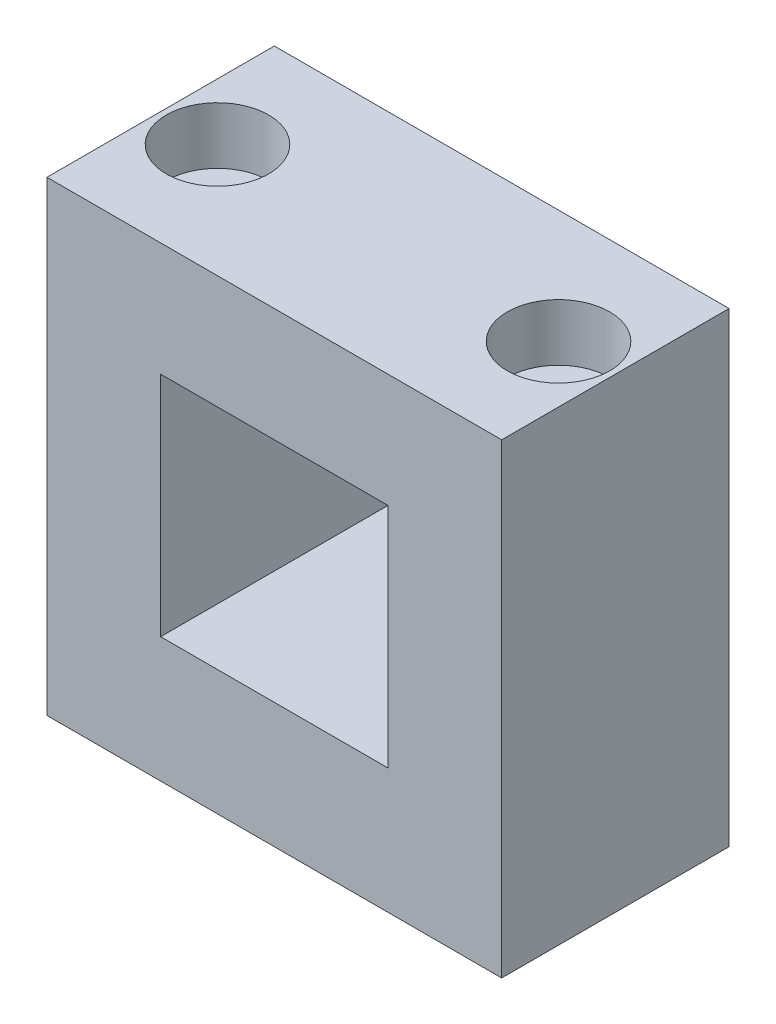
ISO-10303-21;
HEADER;
FILE_DESCRIPTION(('STEP AP214'),'2;1');
FILE_NAME('part.step','',(''),(''),'','','');
FILE_SCHEMA(('AUTOMOTIVE_DESIGN { 1 0 10303 214 1 1 1 1 }'));
ENDSEC;
DATA;
#1=APPLICATION_CONTEXT('core data for automotive mechanical design processes');
#2=APPLICATION_PROTOCOL_DEFINITION('international standard','automotive_design',2000,#1);
#3=PRODUCT_CONTEXT('',#1,'mechanical');
#4=PRODUCT('Part','Part','',(#3));
#5=PRODUCT_RELATED_PRODUCT_CATEGORY('part','',(#4));
#6=PRODUCT_DEFINITION_FORMATION('','',#4);
#7=PRODUCT_DEFINITION_CONTEXT('part definition',#1,'design');
#8=PRODUCT_DEFINITION('design','',#6,#7);
#9=PRODUCT_DEFINITION_SHAPE('','',#8);
#10=(LENGTH_UNIT() NAMED_UNIT(*) SI_UNIT(.MILLI.,.METRE.));
#11=(NAMED_UNIT(*) PLANE_ANGLE_UNIT() SI_UNIT($,.RADIAN.));
#12=(NAMED_UNIT(*) SI_UNIT($,.STERADIAN.) SOLID_ANGLE_UNIT());
#13=UNCERTAINTY_MEASURE_WITH_UNIT(LENGTH_MEASURE(1.E-05),#10,'distance_accuracy_value','');
#14=(GEOMETRIC_REPRESENTATION_CONTEXT(3) GLOBAL_UNCERTAINTY_ASSIGNED_CONTEXT((#13)) GLOBAL_UNIT_ASSIGNED_CONTEXT((#10,
#11,#12)) REPRESENTATION_CONTEXT('',''));
#15=CARTESIAN_POINT('',(0.,0.,0.));
#16=DIRECTION('',(0.,0.,1.));
#17=DIRECTION('',(1.,0.,0.));
#18=AXIS2_PLACEMENT_3D('',#15,#16,#17);
#19=CARTESIAN_POINT('',(19.05,-35.0152561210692,0.));
#20=DIRECTION('',(0.,1.,0.));
#21=DIRECTION('',(-1.,0.,0.));
#22=AXIS2_PLACEMENT_3D('',#19,#20,#21);
#23=CYLINDRICAL_SURFACE('',#22,3.175);
#24=CARTESIAN_POINT('',(19.05,-26.035,0.));
#25=DIRECTION('',(0.,1.,0.));
#26=DIRECTION('',(-1.,0.,0.));
#27=AXIS2_PLACEMENT_3D('',#24,#25,#26);
#28=CIRCLE('',#27,3.175);
#29=CARTESIAN_POINT('',(15.875,-26.035,0.));
#30=VERTEX_POINT('',#29);
#31=EDGE_CURVE('E170',#30,#30,#28,.F.);
#32=ORIENTED_EDGE('',*,*,#31,.T.);
#33=EDGE_LOOP('',(#32));
#34=FACE_BOUND('',#33,.T.);
#35=CARTESIAN_POINT('',(19.05,19.685,0.));
#36=DIRECTION('',(0.,1.,0.));
#37=DIRECTION('',(-1.,0.,0.));
#38=AXIS2_PLACEMENT_3D('',#35,#36,#37);
#39=CIRCLE('',#38,3.175);
#40=CARTESIAN_POINT('',(15.875,19.685,0.));
#41=VERTEX_POINT('',#40);
#42=EDGE_CURVE('E38',#41,#41,#39,.F.);
#43=ORIENTED_EDGE('',*,*,#42,.F.);
#44=EDGE_LOOP('',(#43));
#45=FACE_BOUND('',#44,.T.);
#46=ADVANCED_FACE('F34',(#34,#45),#23,.F.);
#47=CARTESIAN_POINT('',(-19.05,-35.0152561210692,0.));
#48=DIRECTION('',(0.,1.,0.));
#49=DIRECTION('',(-1.,0.,0.));
#50=AXIS2_PLACEMENT_3D('',#47,#48,#49);
#51=CYLINDRICAL_SURFACE('',#50,3.175);
#52=CARTESIAN_POINT('',(-19.05,-26.035,0.));
#53=DIRECTION('',(0.,1.,0.));
#54=DIRECTION('',(-1.,0.,0.));
#55=AXIS2_PLACEMENT_3D('',#52,#53,#54);
#56=CIRCLE('',#55,3.175);
#57=CARTESIAN_POINT('',(-22.225,-26.035,0.));
#58=VERTEX_POINT('',#57);
#59=EDGE_CURVE('E130',#58,#58,#56,.F.);
#60=ORIENTED_EDGE('',*,*,#59,.T.);
#61=EDGE_LOOP('',(#60));
#62=FACE_BOUND('',#61,.T.);
#63=CARTESIAN_POINT('',(-19.05,19.685,0.));
#64=DIRECTION('',(0.,1.,0.));
#65=DIRECTION('',(-1.,0.,0.));
#66=AXIS2_PLACEMENT_3D('',#63,#64,#65);
#67=CIRCLE('',#66,3.175);
#68=CARTESIAN_POINT('',(-22.225,19.685,0.));
#69=VERTEX_POINT('',#68);
#70=EDGE_CURVE('E164',#69,#69,#67,.F.);
#71=ORIENTED_EDGE('',*,*,#70,.F.);
#72=EDGE_LOOP('',(#71));
#73=FACE_BOUND('',#72,.T.);
#74=ADVANCED_FACE('F222',(#62,#73),#51,.F.);
#75=CARTESIAN_POINT('',(0.,0.,12.7));
#76=DIRECTION('',(0.,0.,-1.));
#77=DIRECTION('',(-1.,0.,0.));
#78=AXIS2_PLACEMENT_3D('',#75,#76,#77);
#79=PLANE('',#78);
#80=DIRECTION('',(0.,1.,0.));
#81=VECTOR('',#80,1.);
#82=CARTESIAN_POINT('',(25.4,-26.035,12.7));
#83=LINE('',#82,#81);
#84=CARTESIAN_POINT('',(25.4,-26.035,12.7));
#85=VERTEX_POINT('',#84);
#86=CARTESIAN_POINT('',(25.4,26.035,12.7));
#87=VERTEX_POINT('',#86);
#88=EDGE_CURVE('E140',#85,#87,#83,.T.);
#89=ORIENTED_EDGE('',*,*,#88,.T.);
#90=DIRECTION('',(-1.,0.,0.));
#91=VECTOR('',#90,1.);
#92=CARTESIAN_POINT('',(-25.4,26.035,12.7));
#93=LINE('',#92,#91);
#94=CARTESIAN_POINT('',(-25.4,26.035,12.7));
#95=VERTEX_POINT('',#94);
#96=EDGE_CURVE('E143',#87,#95,#93,.T.);
#97=ORIENTED_EDGE('',*,*,#96,.T.);
#98=DIRECTION('',(0.,-1.,0.));
#99=VECTOR('',#98,1.);
#100=CARTESIAN_POINT('',(-25.4,-26.035,12.7));
#101=LINE('',#100,#99);
#102=CARTESIAN_POINT('',(-25.4,-26.035,12.7));
#103=VERTEX_POINT('',#102);
#104=EDGE_CURVE('E146',#95,#103,#101,.T.);
#105=ORIENTED_EDGE('',*,*,#104,.T.);
#106=DIRECTION('',(1.,0.,0.));
#107=VECTOR('',#106,1.);
#108=CARTESIAN_POINT('',(-25.4,-26.035,12.7));
#109=LINE('',#108,#107);
#110=EDGE_CURVE('E148',#103,#85,#109,.T.);
#111=ORIENTED_EDGE('',*,*,#110,.T.);
#112=EDGE_LOOP('',(#89,#97,#105,#111));
#113=FACE_BOUND('',#112,.T.);
#114=DIRECTION('',(0.,1.,0.));
#115=VECTOR('',#114,1.);
#116=CARTESIAN_POINT('',(12.7,13.335,12.7));
#117=LINE('',#116,#115);
#118=CARTESIAN_POINT('',(12.7,-12.065,12.7));
#119=VERTEX_POINT('',#118);
#120=CARTESIAN_POINT('',(12.7,13.335,12.7));
#121=VERTEX_POINT('',#120);
#122=EDGE_CURVE('E101',#119,#121,#117,.T.);
#123=ORIENTED_EDGE('',*,*,#122,.F.);
#124=DIRECTION('',(1.,0.,0.));
#125=VECTOR('',#124,1.);
#126=CARTESIAN_POINT('',(-12.7,-12.065,12.7));
#127=LINE('',#126,#125);
#128=CARTESIAN_POINT('',(-12.7,-12.065,12.7));
#129=VERTEX_POINT('',#128);
#130=EDGE_CURVE('E124',#129,#119,#127,.T.);
#131=ORIENTED_EDGE('',*,*,#130,.F.);
#132=DIRECTION('',(0.,-1.,0.));
#133=VECTOR('',#132,1.);
#134=CARTESIAN_POINT('',(-12.7,13.335,12.7));
#135=LINE('',#134,#133);
#136=CARTESIAN_POINT('',(-12.7,13.335,12.7));
#137=VERTEX_POINT('',#136);
#138=EDGE_CURVE('E122',#137,#129,#135,.T.);
#139=ORIENTED_EDGE('',*,*,#138,.F.);
#140=DIRECTION('',(-1.,0.,0.));
#141=VECTOR('',#140,1.);
#142=CARTESIAN_POINT('',(-12.7,13.335,12.7));
#143=LINE('',#142,#141);
#144=EDGE_CURVE('E109',#121,#137,#143,.T.);
#145=ORIENTED_EDGE('',*,*,#144,.F.);
#146=EDGE_LOOP('',(#123,#131,#139,#145));
#147=FACE_BOUND('',#146,.T.);
#148=ADVANCED_FACE('F121',(#113,#147),#79,.F.);
#149=CARTESIAN_POINT('',(0.,0.,-12.7));
#150=DIRECTION('',(0.,0.,-1.));
#151=DIRECTION('',(-1.,0.,0.));
#152=AXIS2_PLACEMENT_3D('',#149,#150,#151);
#153=PLANE('',#152);
#154=DIRECTION('',(0.,1.,0.));
#155=VECTOR('',#154,1.);
#156=CARTESIAN_POINT('',(25.4,-26.035,-12.7));
#157=LINE('',#156,#155);
#158=CARTESIAN_POINT('',(25.4,-26.035,-12.7));
#159=VERTEX_POINT('',#158);
#160=CARTESIAN_POINT('',(25.4,26.035,-12.7));
#161=VERTEX_POINT('',#160);
#162=EDGE_CURVE('E117',#159,#161,#157,.T.);
#163=ORIENTED_EDGE('',*,*,#162,.F.);
#164=DIRECTION('',(1.,0.,0.));
#165=VECTOR('',#164,1.);
#166=CARTESIAN_POINT('',(-25.4,-26.035,-12.7));
#167=LINE('',#166,#165);
#168=CARTESIAN_POINT('',(-25.4,-26.035,-12.7));
#169=VERTEX_POINT('',#168);
#170=EDGE_CURVE('E144',#169,#159,#167,.T.);
#171=ORIENTED_EDGE('',*,*,#170,.F.);
#172=DIRECTION('',(0.,-1.,0.));
#173=VECTOR('',#172,1.);
#174=CARTESIAN_POINT('',(-25.4,-26.035,-12.7));
#175=LINE('',#174,#173);
#176=CARTESIAN_POINT('',(-25.4,26.035,-12.7));
#177=VERTEX_POINT('',#176);
#178=EDGE_CURVE('E155',#177,#169,#175,.T.);
#179=ORIENTED_EDGE('',*,*,#178,.F.);
#180=DIRECTION('',(-1.,0.,0.));
#181=VECTOR('',#180,1.);
#182=CARTESIAN_POINT('',(-25.4,26.035,-12.7));
#183=LINE('',#182,#181);
#184=EDGE_CURVE('E153',#161,#177,#183,.T.);
#185=ORIENTED_EDGE('',*,*,#184,.F.);
#186=EDGE_LOOP('',(#163,#171,#179,#185));
#187=FACE_BOUND('',#186,.T.);
#188=DIRECTION('',(1.,0.,0.));
#189=VECTOR('',#188,1.);
#190=CARTESIAN_POINT('',(-12.7,-12.065,-12.7));
#191=LINE('',#190,#189);
#192=CARTESIAN_POINT('',(-12.7,-12.065,-12.7));
#193=VERTEX_POINT('',#192);
#194=CARTESIAN_POINT('',(12.7,-12.065,-12.7));
#195=VERTEX_POINT('',#194);
#196=EDGE_CURVE('E110',#193,#195,#191,.T.);
#197=ORIENTED_EDGE('',*,*,#196,.T.);
#198=DIRECTION('',(0.,1.,0.));
#199=VECTOR('',#198,1.);
#200=CARTESIAN_POINT('',(12.7,13.335,-12.7));
#201=LINE('',#200,#199);
#202=CARTESIAN_POINT('',(12.7,13.335,-12.7));
#203=VERTEX_POINT('',#202);
#204=EDGE_CURVE('E59',#195,#203,#201,.T.);
#205=ORIENTED_EDGE('',*,*,#204,.T.);
#206=DIRECTION('',(-1.,0.,0.));
#207=VECTOR('',#206,1.);
#208=CARTESIAN_POINT('',(-12.7,13.335,-12.7));
#209=LINE('',#208,#207);
#210=CARTESIAN_POINT('',(-12.7,13.335,-12.7));
#211=VERTEX_POINT('',#210);
#212=EDGE_CURVE('E116',#203,#211,#209,.T.);
#213=ORIENTED_EDGE('',*,*,#212,.T.);
#214=DIRECTION('',(0.,-1.,0.));
#215=VECTOR('',#214,1.);
#216=CARTESIAN_POINT('',(-12.7,13.335,-12.7));
#217=LINE('',#216,#215);
#218=EDGE_CURVE('E132',#211,#193,#217,.T.);
#219=ORIENTED_EDGE('',*,*,#218,.T.);
#220=EDGE_LOOP('',(#197,#205,#213,#219));
#221=FACE_BOUND('',#220,.T.);
#222=ADVANCED_FACE('F207',(#187,#221),#153,.T.);
#223=CARTESIAN_POINT('',(25.4,-26.035,12.7));
#224=DIRECTION('',(-1.,0.,0.));
#225=DIRECTION('',(0.,-1.,0.));
#226=AXIS2_PLACEMENT_3D('',#223,#224,#225);
#227=PLANE('',#226);
#228=ORIENTED_EDGE('',*,*,#162,.T.);
#229=DIRECTION('',(0.,0.,-1.));
#230=VECTOR('',#229,1.);
#231=CARTESIAN_POINT('',(25.4,26.035,12.7));
#232=LINE('',#231,#230);
#233=EDGE_CURVE('E11',#87,#161,#232,.T.);
#234=ORIENTED_EDGE('',*,*,#233,.F.);
#235=ORIENTED_EDGE('',*,*,#88,.F.);
#236=DIRECTION('',(0.,0.,-1.));
#237=VECTOR('',#236,1.);
#238=CARTESIAN_POINT('',(25.4,-26.035,12.7));
#239=LINE('',#238,#237);
#240=EDGE_CURVE('E150',#85,#159,#239,.T.);
#241=ORIENTED_EDGE('',*,*,#240,.T.);
#242=EDGE_LOOP('',(#228,#234,#235,#241));
#243=FACE_BOUND('',#242,.T.);
#244=ADVANCED_FACE('F36',(#243),#227,.F.);
#245=CARTESIAN_POINT('',(-25.4,26.035,12.7));
#246=DIRECTION('',(0.,-1.,0.));
#247=DIRECTION('',(1.,0.,0.));
#248=AXIS2_PLACEMENT_3D('',#245,#246,#247);
#249=PLANE('',#248);
#250=CARTESIAN_POINT('',(-19.05,26.035,0.));
#251=DIRECTION('',(0.,1.,0.));
#252=DIRECTION('',(-1.,0.,0.));
#253=AXIS2_PLACEMENT_3D('',#250,#251,#252);
#254=CIRCLE('',#253,5.715);
#255=CARTESIAN_POINT('',(-24.765,26.035,0.));
#256=VERTEX_POINT('',#255);
#257=EDGE_CURVE('E172',#256,#256,#254,.T.);
#258=ORIENTED_EDGE('',*,*,#257,.F.);
#259=EDGE_LOOP('',(#258));
#260=FACE_BOUND('',#259,.T.);
#261=CARTESIAN_POINT('',(19.05,26.035,0.));
#262=DIRECTION('',(0.,1.,0.));
#263=DIRECTION('',(-1.,0.,0.));
#264=AXIS2_PLACEMENT_3D('',#261,#262,#263);
#265=CIRCLE('',#264,5.715);
#266=CARTESIAN_POINT('',(13.335,26.035,0.));
#267=VERTEX_POINT('',#266);
#268=EDGE_CURVE('E182',#267,#267,#265,.T.);
#269=ORIENTED_EDGE('',*,*,#268,.F.);
#270=EDGE_LOOP('',(#269));
#271=FACE_BOUND('',#270,.T.);
#272=ORIENTED_EDGE('',*,*,#184,.T.);
#273=DIRECTION('',(0.,0.,-1.));
#274=VECTOR('',#273,1.);
#275=CARTESIAN_POINT('',(-25.4,26.035,12.7));
#276=LINE('',#275,#274);
#277=EDGE_CURVE('E43',#95,#177,#276,.T.);
#278=ORIENTED_EDGE('',*,*,#277,.F.);
#279=ORIENTED_EDGE('',*,*,#96,.F.);
#280=ORIENTED_EDGE('',*,*,#233,.T.);
#281=EDGE_LOOP('',(#272,#278,#279,#280));
#282=FACE_BOUND('',#281,.T.);
#283=ADVANCED_FACE('F211',(#260,#271,#282),#249,.F.);
#284=CARTESIAN_POINT('',(-25.4,-26.035,12.7));
#285=DIRECTION('',(1.,0.,0.));
#286=DIRECTION('',(0.,1.,0.));
#287=AXIS2_PLACEMENT_3D('',#284,#285,#286);
#288=PLANE('',#287);
#289=ORIENTED_EDGE('',*,*,#178,.T.);
#290=DIRECTION('',(0.,0.,-1.));
#291=VECTOR('',#290,1.);
#292=CARTESIAN_POINT('',(-25.4,-26.035,12.7));
#293=LINE('',#292,#291);
#294=EDGE_CURVE('E160',#103,#169,#293,.T.);
#295=ORIENTED_EDGE('',*,*,#294,.F.);
#296=ORIENTED_EDGE('',*,*,#104,.F.);
#297=ORIENTED_EDGE('',*,*,#277,.T.);
#298=EDGE_LOOP('',(#289,#295,#296,#297));
#299=FACE_BOUND('',#298,.T.);
#300=ADVANCED_FACE('F194',(#299),#288,.F.);
#301=CARTESIAN_POINT('',(-25.4,-26.035,12.7));
#302=DIRECTION('',(0.,1.,0.));
#303=DIRECTION('',(-1.,0.,0.));
#304=AXIS2_PLACEMENT_3D('',#301,#302,#303);
#305=PLANE('',#304);
#306=ORIENTED_EDGE('',*,*,#59,.F.);
#307=EDGE_LOOP('',(#306));
#308=FACE_BOUND('',#307,.T.);
#309=ORIENTED_EDGE('',*,*,#31,.F.);
#310=EDGE_LOOP('',(#309));
#311=FACE_BOUND('',#310,.T.);
#312=ORIENTED_EDGE('',*,*,#170,.T.);
#313=ORIENTED_EDGE('',*,*,#240,.F.);
#314=ORIENTED_EDGE('',*,*,#110,.F.);
#315=ORIENTED_EDGE('',*,*,#294,.T.);
#316=EDGE_LOOP('',(#312,#313,#314,#315));
#317=FACE_BOUND('',#316,.T.);
#318=ADVANCED_FACE('F191',(#308,#311,#317),#305,.F.);
#319=CARTESIAN_POINT('',(12.7,13.335,12.7));
#320=DIRECTION('',(-1.,0.,0.));
#321=DIRECTION('',(0.,-1.,0.));
#322=AXIS2_PLACEMENT_3D('',#319,#320,#321);
#323=PLANE('',#322);
#324=ORIENTED_EDGE('',*,*,#204,.F.);
#325=DIRECTION('',(0.,0.,-1.));
#326=VECTOR('',#325,1.);
#327=CARTESIAN_POINT('',(12.7,-12.065,12.7));
#328=LINE('',#327,#326);
#329=EDGE_CURVE('E105',#119,#195,#328,.T.);
#330=ORIENTED_EDGE('',*,*,#329,.F.);
#331=ORIENTED_EDGE('',*,*,#122,.T.);
#332=DIRECTION('',(0.,0.,-1.));
#333=VECTOR('',#332,1.);
#334=CARTESIAN_POINT('',(12.7,13.335,12.7));
#335=LINE('',#334,#333);
#336=EDGE_CURVE('E104',#121,#203,#335,.T.);
#337=ORIENTED_EDGE('',*,*,#336,.T.);
#338=EDGE_LOOP('',(#324,#330,#331,#337));
#339=FACE_BOUND('',#338,.T.);
#340=ADVANCED_FACE('F103',(#339),#323,.T.);
#341=CARTESIAN_POINT('',(-12.7,13.335,12.7));
#342=DIRECTION('',(0.,-1.,0.));
#343=DIRECTION('',(1.,0.,0.));
#344=AXIS2_PLACEMENT_3D('',#341,#342,#343);
#345=PLANE('',#344);
#346=ORIENTED_EDGE('',*,*,#212,.F.);
#347=ORIENTED_EDGE('',*,*,#336,.F.);
#348=ORIENTED_EDGE('',*,*,#144,.T.);
#349=DIRECTION('',(0.,0.,-1.));
#350=VECTOR('',#349,1.);
#351=CARTESIAN_POINT('',(-12.7,13.335,12.7));
#352=LINE('',#351,#350);
#353=EDGE_CURVE('E118',#137,#211,#352,.T.);
#354=ORIENTED_EDGE('',*,*,#353,.T.);
#355=EDGE_LOOP('',(#346,#347,#348,#354));
#356=FACE_BOUND('',#355,.T.);
#357=ADVANCED_FACE('F113',(#356),#345,.T.);
#358=CARTESIAN_POINT('',(-12.7,13.335,12.7));
#359=DIRECTION('',(1.,0.,0.));
#360=DIRECTION('',(0.,1.,0.));
#361=AXIS2_PLACEMENT_3D('',#358,#359,#360);
#362=PLANE('',#361);
#363=ORIENTED_EDGE('',*,*,#218,.F.);
#364=ORIENTED_EDGE('',*,*,#353,.F.);
#365=ORIENTED_EDGE('',*,*,#138,.T.);
#366=DIRECTION('',(0.,0.,-1.));
#367=VECTOR('',#366,1.);
#368=CARTESIAN_POINT('',(-12.7,-12.065,12.7));
#369=LINE('',#368,#367);
#370=EDGE_CURVE('E51',#129,#193,#369,.T.);
#371=ORIENTED_EDGE('',*,*,#370,.T.);
#372=EDGE_LOOP('',(#363,#364,#365,#371));
#373=FACE_BOUND('',#372,.T.);
#374=ADVANCED_FACE('F235',(#373),#362,.T.);
#375=CARTESIAN_POINT('',(-12.7,-12.065,12.7));
#376=DIRECTION('',(0.,1.,0.));
#377=DIRECTION('',(0.,0.,1.));
#378=AXIS2_PLACEMENT_3D('',#375,#376,#377);
#379=PLANE('',#378);
#380=ORIENTED_EDGE('',*,*,#196,.F.);
#381=ORIENTED_EDGE('',*,*,#370,.F.);
#382=ORIENTED_EDGE('',*,*,#130,.T.);
#383=ORIENTED_EDGE('',*,*,#329,.T.);
#384=EDGE_LOOP('',(#380,#381,#382,#383));
#385=FACE_BOUND('',#384,.T.);
#386=ADVANCED_FACE('F231',(#385),#379,.T.);
#387=CARTESIAN_POINT('',(-19.05,19.685,0.));
#388=DIRECTION('',(0.,1.,0.));
#389=DIRECTION('',(-1.,0.,0.));
#390=AXIS2_PLACEMENT_3D('',#387,#388,#389);
#391=PLANE('',#390);
#392=CARTESIAN_POINT('',(-19.05,19.685,0.));
#393=DIRECTION('',(0.,1.,0.));
#394=DIRECTION('',(-1.,0.,0.));
#395=AXIS2_PLACEMENT_3D('',#392,#393,#394);
#396=CIRCLE('',#395,5.715);
#397=CARTESIAN_POINT('',(-24.765,19.685,0.));
#398=VERTEX_POINT('',#397);
#399=EDGE_CURVE('E166',#398,#398,#396,.T.);
#400=ORIENTED_EDGE('',*,*,#399,.T.);
#401=EDGE_LOOP('',(#400));
#402=FACE_BOUND('',#401,.T.);
#403=ORIENTED_EDGE('',*,*,#70,.T.);
#404=EDGE_LOOP('',(#403));
#405=FACE_BOUND('',#404,.T.);
#406=ADVANCED_FACE('F234',(#402,#405),#391,.T.);
#407=CARTESIAN_POINT('',(-19.05,19.685,0.));
#408=DIRECTION('',(0.,1.,0.));
#409=DIRECTION('',(-1.,0.,0.));
#410=AXIS2_PLACEMENT_3D('',#407,#408,#409);
#411=CYLINDRICAL_SURFACE('',#410,5.715);
#412=ORIENTED_EDGE('',*,*,#399,.F.);
#413=EDGE_LOOP('',(#412));
#414=FACE_BOUND('',#413,.T.);
#415=ORIENTED_EDGE('',*,*,#257,.T.);
#416=EDGE_LOOP('',(#415));
#417=FACE_BOUND('',#416,.T.);
#418=ADVANCED_FACE('F268',(#414,#417),#411,.F.);
#419=CARTESIAN_POINT('',(19.05,19.685,0.));
#420=DIRECTION('',(0.,1.,0.));
#421=DIRECTION('',(-1.,0.,0.));
#422=AXIS2_PLACEMENT_3D('',#419,#420,#421);
#423=PLANE('',#422);
#424=CARTESIAN_POINT('',(19.05,19.685,0.));
#425=DIRECTION('',(0.,1.,0.));
#426=DIRECTION('',(-1.,0.,0.));
#427=AXIS2_PLACEMENT_3D('',#424,#425,#426);
#428=CIRCLE('',#427,5.715);
#429=CARTESIAN_POINT('',(13.335,19.685,0.));
#430=VERTEX_POINT('',#429);
#431=EDGE_CURVE('E177',#430,#430,#428,.T.);
#432=ORIENTED_EDGE('',*,*,#431,.T.);
#433=EDGE_LOOP('',(#432));
#434=FACE_BOUND('',#433,.T.);
#435=ORIENTED_EDGE('',*,*,#42,.T.);
#436=EDGE_LOOP('',(#435));
#437=FACE_BOUND('',#436,.T.);
#438=ADVANCED_FACE('F278',(#434,#437),#423,.T.);
#439=CARTESIAN_POINT('',(19.05,19.685,0.));
#440=DIRECTION('',(0.,1.,0.));
#441=DIRECTION('',(-1.,0.,0.));
#442=AXIS2_PLACEMENT_3D('',#439,#440,#441);
#443=CYLINDRICAL_SURFACE('',#442,5.715);
#444=ORIENTED_EDGE('',*,*,#431,.F.);
#445=EDGE_LOOP('',(#444));
#446=FACE_BOUND('',#445,.T.);
#447=ORIENTED_EDGE('',*,*,#268,.T.);
#448=EDGE_LOOP('',(#447));
#449=FACE_BOUND('',#448,.T.);
#450=ADVANCED_FACE('F288',(#446,#449),#443,.F.);
#451=CLOSED_SHELL('',(#46,#74,#148,#222,#244,#283,#300,#318,#340,#357,#374,#386,#406,#418,#438,#450));
#452=MANIFOLD_SOLID_BREP('B2',#451);
#453=ADVANCED_BREP_SHAPE_REPRESENTATION('',(#18,#452),#14);
#454=SHAPE_DEFINITION_REPRESENTATION(#9,#453);
ENDSEC;
END-ISO-10303-21;
